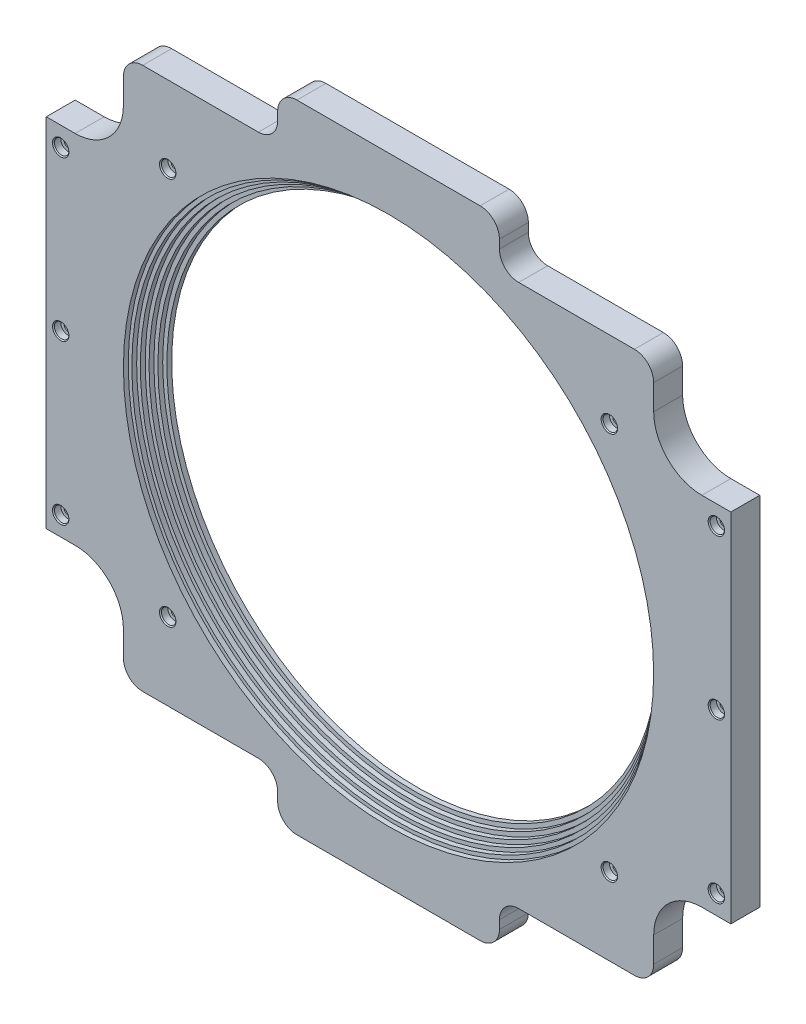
from build123d import *

# Parameters (mm, degrees)
SKETCH1_W                                    = 450.85
SKETCH1_H                                    = 419.1
EXTRUDE1_DEPTH                               = 19.05
CUT_EXTRUDE2_DEPTH                           = 309.367533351
CSK_FOR_10_FLAT_HEAD_MACHINE_SCREW1_AT_COUNT = 2
CSK_FOR_10_FLAT_HEAD_MACHINE_SCREW1_AT_PITCH = 209.55
CSK_FOR_10_FLAT_HEAD_MACHINE_SCREW1_2_COUNT  = 2
CSK_FOR_10_FLAT_HEAD_MACHINE_SCREW1_2_PITCH  = 479.96087601
CSK_FOR_10_FLAT_HEAD_MACHINE_SCREW1_3_COUNT  = 2
CSK_FOR_10_FLAT_HEAD_MACHINE_SCREW1_3_PITCH  = 431.8
CSK_FOR_10_FLAT_HEAD_MACHINE_SCREW1_4_COUNT  = 2
CSK_FOR_10_FLAT_HEAD_MACHINE_SCREW1_4_PITCH  = 104.775
CSK_FOR_10_FLAT_HEAD_MACHINE_SCREW1_5_COUNT  = 2
CSK_FOR_10_FLAT_HEAD_MACHINE_SCREW1_5_PITCH  = 444.329878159
CUT_EXTRUDE6_DEPTH                           = 309.367533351
CBORE_FOR_10_SOCKET_HEAD_CAP_SCREW1_AT_COUNT = 2
CBORE_FOR_10_SOCKET_HEAD_CAP_SCREW1_AT_PITCH = 255.524
CBORE_FOR_10_SOCKET_HEAD_CAP_SCREW1_2_COUNT  = 2
CBORE_FOR_10_SOCKET_HEAD_CAP_SCREW1_2_PITCH  = 387.136414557
CBORE_FOR_10_SOCKET_HEAD_CAP_SCREW1_3_COUNT  = 2
CBORE_FOR_10_SOCKET_HEAD_CAP_SCREW1_3_PITCH  = 290.83
FILLET3_R                                    = 12.7


with BuildPart() as part:
    # Sketch1 → Extrude1 (new body)
    with BuildSketch(Plane.XY):
        Rectangle(SKETCH1_W, SKETCH1_H)
    extrude(amount=EXTRUDE1_DEPTH)

    # Sketch4 → Cut-Revolve1 (revolve, cut)
    with BuildSketch(Plane(origin=(0, 0, 0), x_dir=(-1, 0, 0), z_dir=(0, 1, 0))):
        with BuildLine():
            Line((-215.9, 146.05), (0, 146.05))
            Line((0, 146.05), (0, -69.85))
            ThreePointArc((0, -69.85), (-152.664354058, -6.614354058), (-215.9, 146.05))
        make_face()
    revolve(axis=Axis((0, 0, 479.169350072), (0, 0, -1)), mode=Mode.SUBTRACT)

    # Sketch6 → Cut-Extrude2 (cut, through all)
    with BuildSketch(Plane.XY.offset(19.05)):
        with BuildLine():
            Line((-174.625, 209.55), (-174.625, 149.225))
            ThreePointArc((-174.625, 149.225), (-183.924359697, 126.774359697), (-206.375, 117.475))
            Line((-206.375, 117.475), (-225.425, 117.475))
            Line((-225.425, 117.475), (-225.425, 209.55))
            Line((-225.425, 209.55), (-174.625, 209.55))
        make_face()
        with BuildLine():
            Line((225.425, 209.55), (225.425, 117.475))
            Line((225.425, 117.475), (206.375, 117.475))
            ThreePointArc((206.375, 117.475), (183.924359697, 126.774359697), (174.625, 149.225))
            Line((174.625, 149.225), (174.625, 209.55))
            Line((174.625, 209.55), (225.425, 209.55))
        make_face()
        with BuildLine():
            Line((174.625, -209.55), (174.625, -149.225))
            ThreePointArc((174.625, -149.225), (183.924359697, -126.774359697), (206.375, -117.475))
            Line((206.375, -117.475), (225.425, -117.475))
            Line((225.425, -117.475), (225.425, -209.55))
            Line((225.425, -209.55), (174.625, -209.55))
        make_face()
        with BuildLine():
            Line((-225.425, -209.55), (-225.425, -117.475))
            Line((-225.425, -117.475), (-206.375, -117.475))
            ThreePointArc((-206.375, -117.475), (-183.924359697, -126.774359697), (-174.625, -149.225))
            Line((-174.625, -149.225), (-174.625, -209.55))
            Line((-174.625, -209.55), (-225.425, -209.55))
        make_face()
    extrude(amount=-CUT_EXTRUDE2_DEPTH, mode=Mode.SUBTRACT)

    # Sketch2 → CSK for _10 Flat Head Machine Screw1 (revolve, cut)
    with BuildSketch(Plane(origin=(-215.9, -104.775, 19.05), x_dir=(0, -1, 0), z_dir=(1, 0, 0))):
        Polygon((0, 0), (0, 19.05), (2.5527, 19.05), (2.5527, 4.826), (4.7625, 4.826), (4.7625, 0.635), (5.3975, 0), align=None)
    csk_for_10_flat_head_machine_screw1 = revolve(axis=Axis((-215.9, -104.775, 25.4), (0, 0, -1)), mode=Mode.SUBTRACT)

    # CSK for _10 Flat Head Machine Screw1 at: CSK for _10 Flat Head Machine Screw1 ×2
    with Locations(*[(0, i * CSK_FOR_10_FLAT_HEAD_MACHINE_SCREW1_AT_PITCH, 0) for i in range(1, CSK_FOR_10_FLAT_HEAD_MACHINE_SCREW1_AT_COUNT)]):
        add(csk_for_10_flat_head_machine_screw1, mode=Mode.SUBTRACT)

    # CSK for _10 Flat Head Machine Screw1 2: CSK for _10 Flat Head Machine Screw1 ×2
    with Locations(*[Vector(0.8996566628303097, 0.43659808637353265, 0) * (i * CSK_FOR_10_FLAT_HEAD_MACHINE_SCREW1_2_PITCH) for i in range(1, CSK_FOR_10_FLAT_HEAD_MACHINE_SCREW1_2_COUNT)]):
        add(csk_for_10_flat_head_machine_screw1, mode=Mode.SUBTRACT)

    # CSK for _10 Flat Head Machine Screw1 3: CSK for _10 Flat Head Machine Screw1 ×2
    with Locations(*[(i * CSK_FOR_10_FLAT_HEAD_MACHINE_SCREW1_3_PITCH, 0, 0) for i in range(1, CSK_FOR_10_FLAT_HEAD_MACHINE_SCREW1_3_COUNT)]):
        add(csk_for_10_flat_head_machine_screw1, mode=Mode.SUBTRACT)

    # CSK for _10 Flat Head Machine Screw1 4: CSK for _10 Flat Head Machine Screw1 ×2
    with Locations(*[(0, i * CSK_FOR_10_FLAT_HEAD_MACHINE_SCREW1_4_PITCH, 0) for i in range(1, CSK_FOR_10_FLAT_HEAD_MACHINE_SCREW1_4_COUNT)]):
        add(csk_for_10_flat_head_machine_screw1, mode=Mode.SUBTRACT)

    # CSK for _10 Flat Head Machine Screw1 5: CSK for _10 Flat Head Machine Screw1 ×2
    with Locations(*[Vector(0.9718005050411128, 0.23580453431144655, 0) * (i * CSK_FOR_10_FLAT_HEAD_MACHINE_SCREW1_5_PITCH) for i in range(1, CSK_FOR_10_FLAT_HEAD_MACHINE_SCREW1_5_COUNT)]):
        add(csk_for_10_flat_head_machine_screw1, mode=Mode.SUBTRACT)

    # Sketch18 → Cut-Extrude6 (cut, through all)
    with BuildSketch(Plane.XY.offset(19.05)):
        with BuildLine():
            Line((-161.925, 178.562), (-85.725, 178.562))
            ThreePointArc((-85.725, 178.562), (-76.744743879, 182.281743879), (-73.025, 191.262))
            Line((-73.025, 191.262), (-73.025, 209.55))
            Line((-73.025, 209.55), (-174.625, 209.55))
            Line((-174.625, 209.55), (-174.625, 165.862))
            ThreePointArc((-174.625, 165.862), (-170.905256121, 174.842256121), (-161.925, 178.562))
        make_face()
        with BuildLine():
            Line((174.625, 209.55), (174.625, 165.862))
            ThreePointArc((174.625, 165.862), (170.905256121, 174.842256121), (161.925, 178.562))
            Line((161.925, 178.562), (85.725, 178.562))
            ThreePointArc((85.725, 178.562), (76.744743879, 182.281743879), (73.025, 191.262))
            Line((73.025, 191.262), (73.025, 209.55))
            Line((73.025, 209.55), (174.625, 209.55))
        make_face()
        with BuildLine():
            Line((161.925, -178.562), (85.725, -178.562))
            ThreePointArc((85.725, -178.562), (76.744743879, -182.281743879), (73.025, -191.262))
            Line((73.025, -191.262), (73.025, -209.55))
            Line((73.025, -209.55), (174.625, -209.55))
            Line((174.625, -209.55), (174.625, -165.862))
            ThreePointArc((174.625, -165.862), (170.905256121, -174.842256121), (161.925, -178.562))
        make_face()
        with BuildLine():
            Line((-174.625, -209.55), (-174.625, -165.862))
            ThreePointArc((-174.625, -165.862), (-170.905256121, -174.842256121), (-161.925, -178.562))
            Line((-161.925, -178.562), (-85.725, -178.562))
            ThreePointArc((-85.725, -178.562), (-76.744743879, -182.281743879), (-73.025, -191.262))
            Line((-73.025, -191.262), (-73.025, -209.55))
            Line((-73.025, -209.55), (-174.625, -209.55))
        make_face()
    extrude(amount=-CUT_EXTRUDE6_DEPTH, mode=Mode.SUBTRACT)

    # Sketch14 → CBORE for _10 Socket Head Cap Screw1 (revolve, cut)
    with BuildSketch(Plane(origin=(-145.415, 127.762, 19.05), x_dir=(0, -1, 0), z_dir=(1, 0, 0))):
        Polygon((0, 0), (0, 19.05), (2.5527, 19.05), (2.5527, 4.826), (4.7625, 4.826), (4.7625, 0.635), (5.3975, 0), align=None)
    cbore_for_10_socket_head_cap_screw1 = revolve(axis=Axis((-145.415, 127.762, 25.4), (0, 0, -1)), mode=Mode.SUBTRACT)

    # CBORE for _10 Socket Head Cap Screw1 at: CBORE for _10 Socket Head Cap Screw1 ×2
    with Locations(*[(0, -i * CBORE_FOR_10_SOCKET_HEAD_CAP_SCREW1_AT_PITCH, 0) for i in range(1, CBORE_FOR_10_SOCKET_HEAD_CAP_SCREW1_AT_COUNT)]):
        add(cbore_for_10_socket_head_cap_screw1, mode=Mode.SUBTRACT)

    # CBORE for _10 Socket Head Cap Screw1 2: CBORE for _10 Socket Head Cap Screw1 ×2
    with Locations(*[Vector(0.7512339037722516, -0.6600360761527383, 0) * (i * CBORE_FOR_10_SOCKET_HEAD_CAP_SCREW1_2_PITCH) for i in range(1, CBORE_FOR_10_SOCKET_HEAD_CAP_SCREW1_2_COUNT)]):
        add(cbore_for_10_socket_head_cap_screw1, mode=Mode.SUBTRACT)

    # CBORE for _10 Socket Head Cap Screw1 3: CBORE for _10 Socket Head Cap Screw1 ×2
    with Locations(*[(i * CBORE_FOR_10_SOCKET_HEAD_CAP_SCREW1_3_PITCH, 0, 0) for i in range(1, CBORE_FOR_10_SOCKET_HEAD_CAP_SCREW1_3_COUNT)]):
        add(cbore_for_10_socket_head_cap_screw1, mode=Mode.SUBTRACT)

    # Fillet3
    fillet3_edges = [part.edges().sort_by_distance(p)[0] for p in [
        (-73.025, 209.55, 9.525),
        (73.025, 209.55, 9.525),
        (73.025, -209.55, 9.525),
        (-73.025, -209.55, 9.525),
    ]]
    fillet(fillet3_edges, radius=FILLET3_R)

    # Sketch19 → Cut-Revolve2 (revolve, cut)
    with BuildSketch(Plane(origin=(0, 0, 0), x_dir=(0, 0, -1), z_dir=(1, 0, 0)), mode=Mode.PRIVATE) as cut_revolve2_sk:
        Polygon((-19.05, -174.596133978), (-15.875, -174.596133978), (-15.875, -172.241921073), (-12.7, -172.241921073), (-12.7, -169.795722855), (-9.525, -169.795722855), (-9.525, -167.253503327), (-6.35, -167.253503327), (-6.35, -164.61081374), (-3.175, -164.61081374), (-3.175, -161.862733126), (0, -161.862733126), (0, -159.003797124), (-19.05, -159.003797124), align=None)
    revolve(cut_revolve2_sk.sketch.rotate(Axis((0, 0, 168.92928321), (0, 0, -1)), 270), axis=Axis((0, 0, 168.92928321), (0, 0, -1)), mode=Mode.SUBTRACT)


solid = part.part
